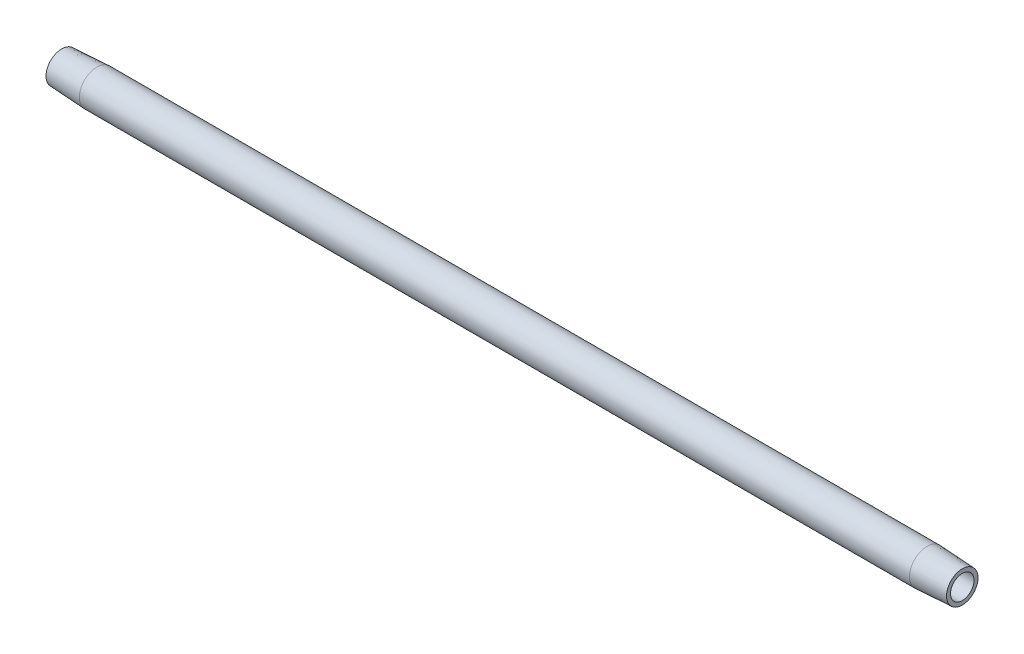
ISO-10303-21;
HEADER;
FILE_DESCRIPTION(('STEP AP214'),'2;1');
FILE_NAME('part.step','',(''),(''),'','','');
FILE_SCHEMA(('AUTOMOTIVE_DESIGN { 1 0 10303 214 1 1 1 1 }'));
ENDSEC;
DATA;
#1=APPLICATION_CONTEXT('core data for automotive mechanical design processes');
#2=APPLICATION_PROTOCOL_DEFINITION('international standard','automotive_design',2000,#1);
#3=PRODUCT_CONTEXT('',#1,'mechanical');
#4=PRODUCT('Part','Part','',(#3));
#5=PRODUCT_RELATED_PRODUCT_CATEGORY('part','',(#4));
#6=PRODUCT_DEFINITION_FORMATION('','',#4);
#7=PRODUCT_DEFINITION_CONTEXT('part definition',#1,'design');
#8=PRODUCT_DEFINITION('design','',#6,#7);
#9=PRODUCT_DEFINITION_SHAPE('','',#8);
#10=(LENGTH_UNIT() NAMED_UNIT(*) SI_UNIT(.MILLI.,.METRE.));
#11=(NAMED_UNIT(*) PLANE_ANGLE_UNIT() SI_UNIT($,.RADIAN.));
#12=(NAMED_UNIT(*) SI_UNIT($,.STERADIAN.) SOLID_ANGLE_UNIT());
#13=UNCERTAINTY_MEASURE_WITH_UNIT(LENGTH_MEASURE(1.E-05),#10,'distance_accuracy_value','');
#14=(GEOMETRIC_REPRESENTATION_CONTEXT(3) GLOBAL_UNCERTAINTY_ASSIGNED_CONTEXT((#13)) GLOBAL_UNIT_ASSIGNED_CONTEXT((#10,
#11,#12)) REPRESENTATION_CONTEXT('',''));
#15=CARTESIAN_POINT('',(0.,0.,0.));
#16=DIRECTION('',(0.,0.,1.));
#17=DIRECTION('',(1.,0.,0.));
#18=AXIS2_PLACEMENT_3D('',#15,#16,#17);
#19=CARTESIAN_POINT('',(0.476141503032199,0.,0.));
#20=DIRECTION('',(-1.,0.,0.));
#21=DIRECTION('',(0.,0.,1.));
#22=AXIS2_PLACEMENT_3D('',#19,#20,#21);
#23=CYLINDRICAL_SURFACE('',#22,3.96875);
#24=CARTESIAN_POINT('',(7.9375,0.,0.));
#25=DIRECTION('',(-1.,0.,0.));
#26=DIRECTION('',(0.,0.,1.));
#27=AXIS2_PLACEMENT_3D('',#24,#25,#26);
#28=CIRCLE('',#27,3.96875);
#29=CARTESIAN_POINT('',(7.9375,0.,3.96875));
#30=VERTEX_POINT('',#29);
#31=EDGE_CURVE('E10',#30,#30,#28,.T.);
#32=ORIENTED_EDGE('',*,*,#31,.F.);
#33=EDGE_LOOP('',(#32));
#34=FACE_BOUND('',#33,.T.);
#35=CARTESIAN_POINT('',(195.2625,0.,0.));
#36=DIRECTION('',(-1.,0.,0.));
#37=DIRECTION('',(0.,0.,1.));
#38=AXIS2_PLACEMENT_3D('',#35,#36,#37);
#39=CIRCLE('',#38,3.96875);
#40=CARTESIAN_POINT('',(195.2625,0.,3.96875));
#41=VERTEX_POINT('',#40);
#42=EDGE_CURVE('E52',#41,#41,#39,.T.);
#43=ORIENTED_EDGE('',*,*,#42,.T.);
#44=EDGE_LOOP('',(#43));
#45=FACE_BOUND('',#44,.T.);
#46=ADVANCED_FACE('F30',(#34,#45),#23,.T.);
#47=CARTESIAN_POINT('',(7.9375,0.,0.));
#48=DIRECTION('',(1.,0.,0.));
#49=DIRECTION('',(0.,0.,-1.));
#50=AXIS2_PLACEMENT_3D('',#47,#48,#49);
#51=CONICAL_SURFACE('',#50,3.96875,0.0523598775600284);
#52=CARTESIAN_POINT('',(0.,0.,0.));
#53=DIRECTION('',(-1.,0.,0.));
#54=DIRECTION('',(0.,0.,1.));
#55=AXIS2_PLACEMENT_3D('',#52,#53,#54);
#56=CIRCLE('',#55,3.55276325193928);
#57=CARTESIAN_POINT('',(0.,0.,3.55276325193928));
#58=VERTEX_POINT('',#57);
#59=EDGE_CURVE('E36',#58,#58,#56,.T.);
#60=ORIENTED_EDGE('',*,*,#59,.F.);
#61=EDGE_LOOP('',(#60));
#62=FACE_BOUND('',#61,.T.);
#63=ORIENTED_EDGE('',*,*,#31,.T.);
#64=EDGE_LOOP('',(#63));
#65=FACE_BOUND('',#64,.T.);
#66=ADVANCED_FACE('F77',(#62,#65),#51,.T.);
#67=CARTESIAN_POINT('',(0.,3.55276325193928,0.));
#68=DIRECTION('',(1.,0.,0.));
#69=DIRECTION('',(0.,0.,-1.));
#70=AXIS2_PLACEMENT_3D('',#67,#68,#69);
#71=PLANE('',#70);
#72=CARTESIAN_POINT('',(0.,0.,0.));
#73=DIRECTION('',(-1.,0.,0.));
#74=DIRECTION('',(0.,0.,1.));
#75=AXIS2_PLACEMENT_3D('',#72,#73,#74);
#76=CIRCLE('',#75,2.65429999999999);
#77=CARTESIAN_POINT('',(0.,0.,2.65429999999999));
#78=VERTEX_POINT('',#77);
#79=EDGE_CURVE('E40',#78,#78,#76,.T.);
#80=ORIENTED_EDGE('',*,*,#79,.F.);
#81=EDGE_LOOP('',(#80));
#82=FACE_BOUND('',#81,.T.);
#83=ORIENTED_EDGE('',*,*,#59,.T.);
#84=EDGE_LOOP('',(#83));
#85=FACE_BOUND('',#84,.T.);
#86=ADVANCED_FACE('F72',(#82,#85),#71,.F.);
#87=CARTESIAN_POINT('',(0.476141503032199,0.,0.));
#88=DIRECTION('',(-1.,0.,0.));
#89=DIRECTION('',(0.,0.,1.));
#90=AXIS2_PLACEMENT_3D('',#87,#88,#89);
#91=CYLINDRICAL_SURFACE('',#90,2.6543);
#92=CARTESIAN_POINT('',(203.2,0.,0.));
#93=DIRECTION('',(-1.,0.,0.));
#94=DIRECTION('',(0.,0.,1.));
#95=AXIS2_PLACEMENT_3D('',#92,#93,#94);
#96=CIRCLE('',#95,2.6543);
#97=CARTESIAN_POINT('',(203.2,0.,2.6543));
#98=VERTEX_POINT('',#97);
#99=EDGE_CURVE('E44',#98,#98,#96,.T.);
#100=ORIENTED_EDGE('',*,*,#99,.F.);
#101=EDGE_LOOP('',(#100));
#102=FACE_BOUND('',#101,.T.);
#103=ORIENTED_EDGE('',*,*,#79,.T.);
#104=EDGE_LOOP('',(#103));
#105=FACE_BOUND('',#104,.T.);
#106=ADVANCED_FACE('F66',(#102,#105),#91,.F.);
#107=CARTESIAN_POINT('',(203.2,2.6543,0.));
#108=DIRECTION('',(-1.,0.,0.));
#109=DIRECTION('',(0.,0.,1.));
#110=AXIS2_PLACEMENT_3D('',#107,#108,#109);
#111=PLANE('',#110);
#112=CARTESIAN_POINT('',(203.2,0.,0.));
#113=DIRECTION('',(-1.,0.,0.));
#114=DIRECTION('',(0.,0.,1.));
#115=AXIS2_PLACEMENT_3D('',#112,#113,#114);
#116=CIRCLE('',#115,3.55276325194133);
#117=CARTESIAN_POINT('',(203.2,0.,3.55276325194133));
#118=VERTEX_POINT('',#117);
#119=EDGE_CURVE('E49',#118,#118,#116,.T.);
#120=ORIENTED_EDGE('',*,*,#119,.F.);
#121=EDGE_LOOP('',(#120));
#122=FACE_BOUND('',#121,.T.);
#123=ORIENTED_EDGE('',*,*,#99,.T.);
#124=EDGE_LOOP('',(#123));
#125=FACE_BOUND('',#124,.T.);
#126=ADVANCED_FACE('F60',(#122,#125),#111,.F.);
#127=CARTESIAN_POINT('',(203.2,0.,0.));
#128=DIRECTION('',(-1.,0.,0.));
#129=DIRECTION('',(0.,0.,1.));
#130=AXIS2_PLACEMENT_3D('',#127,#128,#129);
#131=CONICAL_SURFACE('',#130,3.55276325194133,0.0523598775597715);
#132=ORIENTED_EDGE('',*,*,#42,.F.);
#133=EDGE_LOOP('',(#132));
#134=FACE_BOUND('',#133,.T.);
#135=ORIENTED_EDGE('',*,*,#119,.T.);
#136=EDGE_LOOP('',(#135));
#137=FACE_BOUND('',#136,.T.);
#138=ADVANCED_FACE('F57',(#134,#137),#131,.T.);
#139=CLOSED_SHELL('',(#46,#66,#86,#106,#126,#138));
#140=MANIFOLD_SOLID_BREP('B2',#139);
#141=ADVANCED_BREP_SHAPE_REPRESENTATION('',(#18,#140),#14);
#142=SHAPE_DEFINITION_REPRESENTATION(#9,#141);
ENDSEC;
END-ISO-10303-21;
